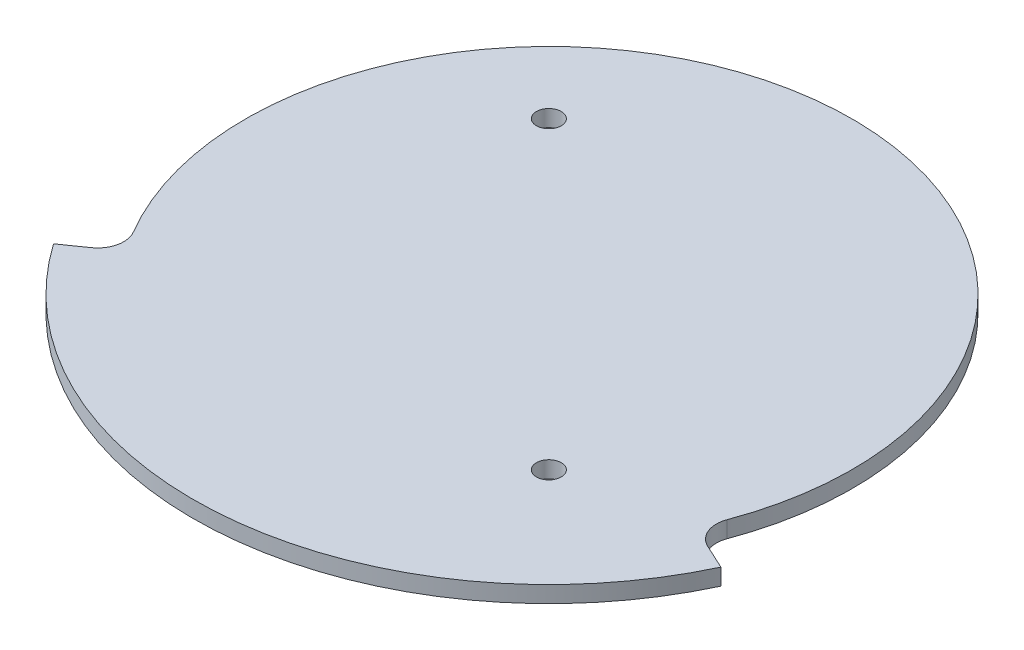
from build123d import *

# Parameters (mm, degrees)
SKETCH1_R           = 136.5
BOSS_EXTRUDE1_DEPTH = 6.35
CUT_EXTRUDE1_DEPTH  = 194.144563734
CUT_EXTRUDE2_REACH  = 186.328
SKETCH3_R           = 4.7625


with BuildPart() as part:
    # Sketch1 → Boss-Extrude1 (new body)
    with BuildSketch(Plane(origin=(0, 0, 0), x_dir=(1, 0, 0), z_dir=(0, 1, 0))):
        with Locations(Location((0, 0, 0), (0, 0, 270))):
            Circle(SKETCH1_R)
    extrude(amount=BOSS_EXTRUDE1_DEPTH)

    # Sketch2 → Cut-Extrude1 (cut, through all)
    with BuildSketch(Plane(origin=(0, 6.35, 0), x_dir=(1, 0, 0), z_dir=(0, 1, 0))):
        with BuildLine():
            Line((-103.298450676, -72.330353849), (-111.814254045, -78.293183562))
            ThreePointArc((-111.814254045, -78.293183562), (-11.896758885, 135.98057629), (123.711012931, -57.687392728))
            Line((123.711012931, -57.687392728), (114.289149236, -53.293905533))
            ThreePointArc((114.289149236, -53.293905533), (109.26105206, -48.02006314), (109.146530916, -40.734319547))
            ThreePointArc((109.146530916, -40.734319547), (-10.15364403, 116.056682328), (-100.414909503, -59.068569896))
            ThreePointArc((-100.414909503, -59.068569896), (-99.262534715, -66.26351306), (-103.298450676, -72.330353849))
        make_face()
    extrude(amount=-CUT_EXTRUDE1_DEPTH, mode=Mode.SUBTRACT)

    # Sketch3 → Cut-Extrude2 (cut, up to next)
    with BuildSketch(Plane(origin=(0, 6.35, 0), x_dir=(1, 0, 0), z_dir=(0, 1, 0)), mode=Mode.PRIVATE) as cut_extrude2_sk1:
        with Locations(Location((58.371664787, -58.371664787, 0), (0, 0, 270))):
            Circle(SKETCH3_R)
    cut_extrude2_tool1 = extrude(cut_extrude2_sk1.sketch, amount=-CUT_EXTRUDE2_REACH, mode=Mode.PRIVATE) & part.part
    # Sketch3 → Cut-Extrude2 (cut, up to next)
    with BuildSketch(Plane(origin=(0, 6.35, 0), x_dir=(1, 0, 0), z_dir=(0, 1, 0)), mode=Mode.PRIVATE) as cut_extrude2_sk2:
        with Locations(Location((-58.371664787, 58.371664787, 0), (0, 0, 270))):
            Circle(SKETCH3_R)
    cut_extrude2_tool2 = extrude(cut_extrude2_sk2.sketch, amount=-CUT_EXTRUDE2_REACH, mode=Mode.PRIVATE) & part.part
    add(cut_extrude2_tool1.solids().sort_by_distance((58.371665, 6.35, 58.371665))[0], mode=Mode.SUBTRACT)
    add(cut_extrude2_tool2.solids().sort_by_distance((-58.371665, 6.35, -58.371665))[0], mode=Mode.SUBTRACT)


solid = part.part
